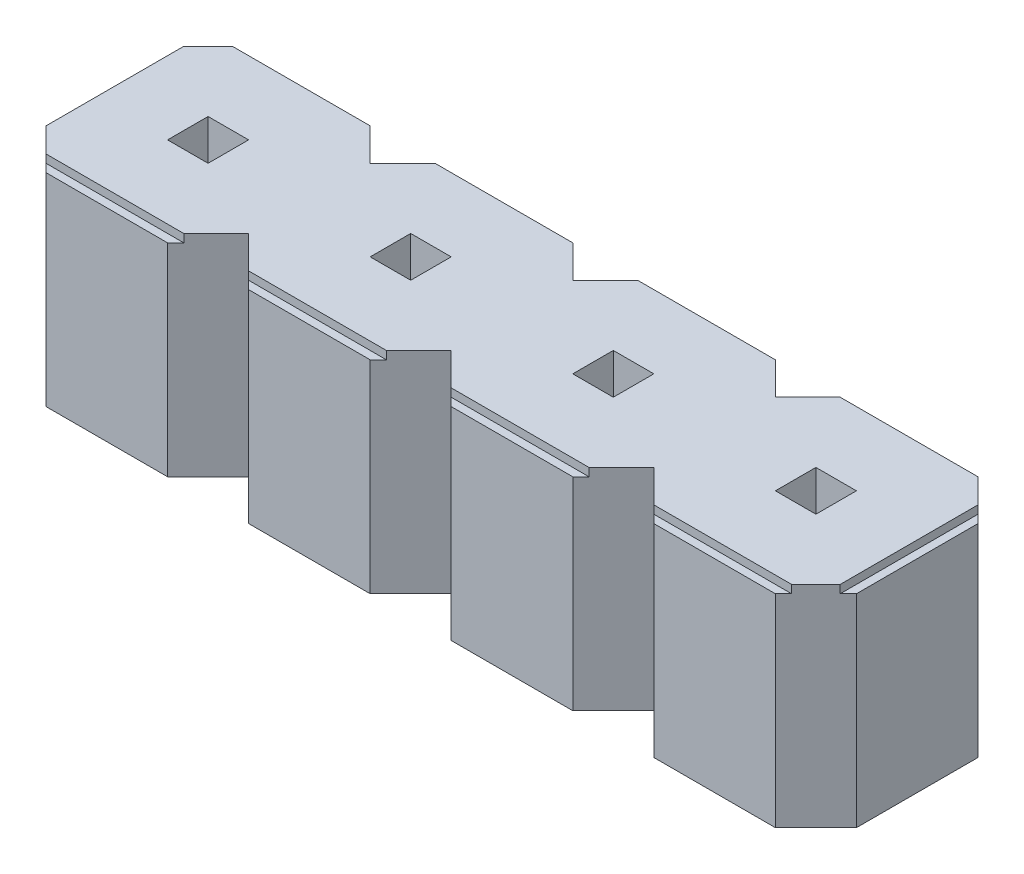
from build123d import *

# Parameters (mm, degrees)
BOSS_EXTRUDE1_DEPTH = 1.3
SKETCH2_W           = 11.59712349
SKETCH2_H           = 4.16940885
SKETCH2_W_2         = 9.8
SKETCH2_H_2         = 2.3
CUT_EXTRUDE1_DEPTH  = 0.1
SKETCH3_W           = 0.5
SKETCH3_H           = 0.5
CUT_EXTRUDE2_DEPTH  = 10.213305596


with BuildPart() as part:
    # Sketch1 → Boss-Extrude1 (new, symmetric)
    with BuildSketch(Plane(origin=(0, 0, 0), x_dir=(1, 0, 0), z_dir=(0, 1, 0))):
        Polygon((3.75, -0.75), (6.25, -0.75), (5.75, -1.25), (4.25, -1.25), align=None)
        Polygon((8.25, -1.25), (8.75, -0.75), (6.25, -0.75), (6.75, -1.25), align=None)
        Polygon((8.75, -0.75), (6.25, -0.75), (3.75, -0.75), (3.25, -1.25), (1.75, -1.25), (1.25, -0.75), (-1.25, -0.75), (-1.25, 0.75), (-0.75, 1.25), (0.75, 1.25), (1.25, 0.75), (1.75, 1.25), (3.25, 1.25), (3.75, 0.75), (4.25, 1.25), (5.75, 1.25), (6.25, 0.75), (6.75, 1.25), (8.25, 1.25), (8.75, 0.75), align=None)
        Polygon((-1.25, -0.75), (1.25, -0.75), (0.75, -1.25), (-0.75, -1.25), align=None)
    extrude(amount=BOSS_EXTRUDE1_DEPTH, both=True)

    # Sketch2 → Cut-Extrude1 (cut)
    with BuildSketch(Plane(origin=(0, 1.3, 0), x_dir=(1, 0, 0), z_dir=(0, 1, 0))):
        with Locations((3.75, 0)):
            Rectangle(SKETCH2_W, SKETCH2_H)
        with Locations((3.75, 0)):
            Rectangle(SKETCH2_W_2, SKETCH2_H_2, mode=Mode.SUBTRACT)
    extrude(amount=-CUT_EXTRUDE1_DEPTH, mode=Mode.SUBTRACT)

    # Sketch3 → Cut-Extrude2 (cut, through all)
    with BuildSketch(Plane(origin=(0, 1.3, 0), x_dir=(1, 0, 0), z_dir=(0, 1, 0))):
        with Locations((2.5, 0)):
            Rectangle(SKETCH3_W, SKETCH3_H)
        Rectangle(SKETCH3_W, SKETCH3_H)
        with Locations((5, 0)):
            Rectangle(SKETCH3_W, SKETCH3_H)
        with Locations((7.5, 0)):
            Rectangle(SKETCH3_W, SKETCH3_H)
    extrude(amount=-CUT_EXTRUDE2_DEPTH, mode=Mode.SUBTRACT)


solid = part.part
